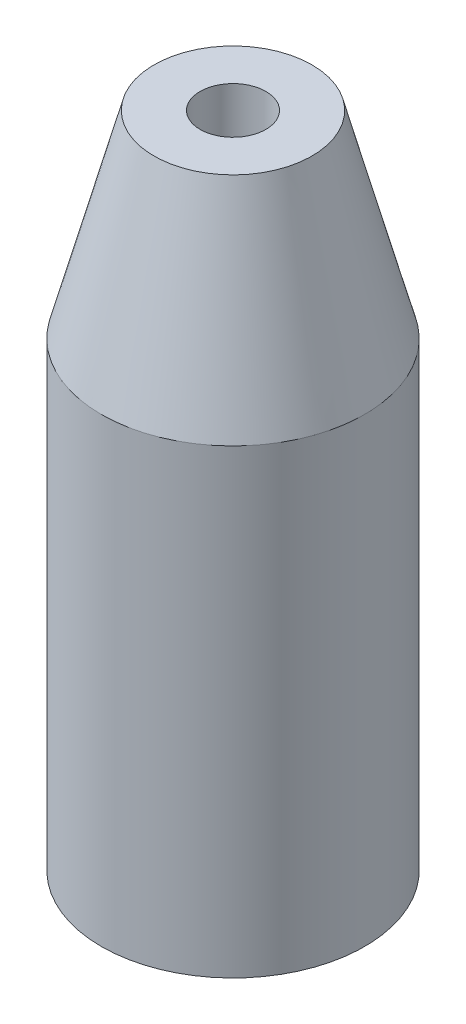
ISO-10303-21;
HEADER;
FILE_DESCRIPTION(('STEP AP214'),'2;1');
FILE_NAME('part.step','',(''),(''),'','','');
FILE_SCHEMA(('AUTOMOTIVE_DESIGN { 1 0 10303 214 1 1 1 1 }'));
ENDSEC;
DATA;
#1=APPLICATION_CONTEXT('core data for automotive mechanical design processes');
#2=APPLICATION_PROTOCOL_DEFINITION('international standard','automotive_design',2000,#1);
#3=PRODUCT_CONTEXT('',#1,'mechanical');
#4=PRODUCT('Part','Part','',(#3));
#5=PRODUCT_RELATED_PRODUCT_CATEGORY('part','',(#4));
#6=PRODUCT_DEFINITION_FORMATION('','',#4);
#7=PRODUCT_DEFINITION_CONTEXT('part definition',#1,'design');
#8=PRODUCT_DEFINITION('design','',#6,#7);
#9=PRODUCT_DEFINITION_SHAPE('','',#8);
#10=(LENGTH_UNIT() NAMED_UNIT(*) SI_UNIT(.MILLI.,.METRE.));
#11=(NAMED_UNIT(*) PLANE_ANGLE_UNIT() SI_UNIT($,.RADIAN.));
#12=(NAMED_UNIT(*) SI_UNIT($,.STERADIAN.) SOLID_ANGLE_UNIT());
#13=UNCERTAINTY_MEASURE_WITH_UNIT(LENGTH_MEASURE(1.E-05),#10,'distance_accuracy_value','');
#14=(GEOMETRIC_REPRESENTATION_CONTEXT(3) GLOBAL_UNCERTAINTY_ASSIGNED_CONTEXT((#13)) GLOBAL_UNIT_ASSIGNED_CONTEXT((#10,
#11,#12)) REPRESENTATION_CONTEXT('',''));
#15=CARTESIAN_POINT('',(0.,0.,0.));
#16=DIRECTION('',(0.,0.,1.));
#17=DIRECTION('',(1.,0.,0.));
#18=AXIS2_PLACEMENT_3D('',#15,#16,#17);
#19=CARTESIAN_POINT('',(-25.,89.9519052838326,0.));
#20=DIRECTION('',(0.,-1.,0.));
#21=DIRECTION('',(0.,0.,-1.));
#22=AXIS2_PLACEMENT_3D('',#19,#20,#21);
#23=CYLINDRICAL_SURFACE('',#22,5.);
#24=CARTESIAN_POINT('',(-25.,3.02896766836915,0.));
#25=DIRECTION('',(0.,-1.,0.));
#26=DIRECTION('',(1.,0.,0.));
#27=AXIS2_PLACEMENT_3D('',#24,#25,#26);
#28=CIRCLE('',#27,5.);
#29=CARTESIAN_POINT('',(-20.,3.02896766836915,0.));
#30=VERTEX_POINT('',#29);
#31=EDGE_CURVE('E60',#30,#30,#28,.T.);
#32=ORIENTED_EDGE('',*,*,#31,.T.);
#33=EDGE_LOOP('',(#32));
#34=FACE_BOUND('',#33,.T.);
#35=CARTESIAN_POINT('',(-25.,0.,0.));
#36=DIRECTION('',(0.,1.,0.));
#37=DIRECTION('',(0.,0.,1.));
#38=AXIS2_PLACEMENT_3D('',#35,#36,#37);
#39=CIRCLE('',#38,5.);
#40=CARTESIAN_POINT('',(-25.,0.,5.));
#41=VERTEX_POINT('',#40);
#42=EDGE_CURVE('E12',#41,#41,#39,.T.);
#43=ORIENTED_EDGE('',*,*,#42,.T.);
#44=EDGE_LOOP('',(#43));
#45=FACE_BOUND('',#44,.T.);
#46=ADVANCED_FACE('F57',(#34,#45),#23,.T.);
#47=CARTESIAN_POINT('',(-25.,0.,0.));
#48=DIRECTION('',(0.,1.,0.));
#49=DIRECTION('',(0.,0.,1.));
#50=AXIS2_PLACEMENT_3D('',#47,#48,#49);
#51=PLANE('',#50);
#52=ORIENTED_EDGE('',*,*,#42,.F.);
#53=EDGE_LOOP('',(#52));
#54=FACE_BOUND('',#53,.T.);
#55=ADVANCED_FACE('F72',(#54),#51,.F.);
#56=CARTESIAN_POINT('',(-25.,3.02896766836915,0.));
#57=DIRECTION('',(0.,-1.,0.));
#58=DIRECTION('',(1.,0.,0.));
#59=AXIS2_PLACEMENT_3D('',#56,#57,#58);
#60=PLANE('',#59);
#61=ORIENTED_EDGE('',*,*,#31,.F.);
#62=EDGE_LOOP('',(#61));
#63=FACE_BOUND('',#62,.T.);
#64=ADVANCED_FACE('F70',(#63),#60,.F.);
#65=CLOSED_SHELL('',(#46,#55,#64));
#66=MANIFOLD_SOLID_BREP('B2',#65);
#67=CARTESIAN_POINT('',(0.,0.,0.));
#68=DIRECTION('',(0.,1.,0.));
#69=DIRECTION('',(0.,0.,1.));
#70=AXIS2_PLACEMENT_3D('',#67,#68,#69);
#71=PLANE('',#70);
#72=CARTESIAN_POINT('',(0.,0.,0.));
#73=DIRECTION('',(0.,1.,0.));
#74=DIRECTION('',(0.,0.,1.));
#75=AXIS2_PLACEMENT_3D('',#72,#73,#74);
#76=CIRCLE('',#75,50.);
#77=CARTESIAN_POINT('',(0.,0.,50.));
#78=VERTEX_POINT('',#77);
#79=EDGE_CURVE('E109',#78,#78,#76,.T.);
#80=ORIENTED_EDGE('',*,*,#79,.F.);
#81=EDGE_LOOP('',(#80));
#82=FACE_BOUND('',#81,.T.);
#83=CARTESIAN_POINT('',(-25.,0.,0.));
#84=DIRECTION('',(0.,1.,0.));
#85=DIRECTION('',(0.,0.,1.));
#86=AXIS2_PLACEMENT_3D('',#83,#84,#85);
#87=CIRCLE('',#86,12.5);
#88=CARTESIAN_POINT('',(-25.,0.,12.5));
#89=VERTEX_POINT('',#88);
#90=EDGE_CURVE('E130',#89,#89,#87,.T.);
#91=ORIENTED_EDGE('',*,*,#90,.T.);
#92=EDGE_LOOP('',(#91));
#93=FACE_BOUND('',#92,.T.);
#94=ADVANCED_FACE('F98',(#82,#93),#71,.F.);
#95=CARTESIAN_POINT('',(0.,250.,0.));
#96=DIRECTION('',(0.,-1.,0.));
#97=DIRECTION('',(0.,0.,-1.));
#98=AXIS2_PLACEMENT_3D('',#95,#96,#97);
#99=CYLINDRICAL_SURFACE('',#98,50.);
#100=CARTESIAN_POINT('',(0.,174.999999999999,0.));
#101=DIRECTION('',(0.,1.,0.));
#102=DIRECTION('',(0.,0.,1.));
#103=AXIS2_PLACEMENT_3D('',#100,#101,#102);
#104=CIRCLE('',#103,50.);
#105=CARTESIAN_POINT('',(0.,174.999999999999,-50.));
#106=VERTEX_POINT('',#105);
#107=EDGE_CURVE('E56',#106,#106,#104,.F.);
#108=ORIENTED_EDGE('',*,*,#107,.T.);
#109=EDGE_LOOP('',(#108));
#110=FACE_BOUND('',#109,.T.);
#111=ORIENTED_EDGE('',*,*,#79,.T.);
#112=EDGE_LOOP('',(#111));
#113=FACE_BOUND('',#112,.T.);
#114=ADVANCED_FACE('F100',(#110,#113),#99,.T.);
#115=CARTESIAN_POINT('',(0.,250.,0.));
#116=DIRECTION('',(0.,1.,0.));
#117=DIRECTION('',(0.,0.,1.));
#118=AXIS2_PLACEMENT_3D('',#115,#116,#117);
#119=PLANE('',#118);
#120=CARTESIAN_POINT('',(0.,250.,0.));
#121=DIRECTION('',(0.,1.,0.));
#122=DIRECTION('',(0.,0.,1.));
#123=AXIS2_PLACEMENT_3D('',#120,#121,#122);
#124=CIRCLE('',#123,12.5);
#125=CARTESIAN_POINT('',(0.,250.,12.5));
#126=VERTEX_POINT('',#125);
#127=EDGE_CURVE('E113',#126,#126,#124,.T.);
#128=ORIENTED_EDGE('',*,*,#127,.F.);
#129=EDGE_LOOP('',(#128));
#130=FACE_BOUND('',#129,.T.);
#131=CARTESIAN_POINT('',(0.,250.,0.));
#132=DIRECTION('',(0.,1.,0.));
#133=DIRECTION('',(0.,0.,1.));
#134=AXIS2_PLACEMENT_3D('',#131,#132,#133);
#135=CIRCLE('',#134,30.);
#136=CARTESIAN_POINT('',(0.,250.,-30.));
#137=VERTEX_POINT('',#136);
#138=EDGE_CURVE('E105',#137,#137,#135,.T.);
#139=ORIENTED_EDGE('',*,*,#138,.T.);
#140=EDGE_LOOP('',(#139));
#141=FACE_BOUND('',#140,.T.);
#142=ADVANCED_FACE('F152',(#130,#141),#119,.T.);
#143=CARTESIAN_POINT('',(0.,250.,0.));
#144=DIRECTION('',(0.,-1.,0.));
#145=DIRECTION('',(0.,0.,-1.));
#146=AXIS2_PLACEMENT_3D('',#143,#144,#145);
#147=CONICAL_SURFACE('',#146,30.,0.260602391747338);
#148=CARTESIAN_POINT('',(0.,174.999999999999,-50.));
#149=CARTESIAN_POINT('',(0.,175.781249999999,-49.7916666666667));
#150=CARTESIAN_POINT('',(0.,176.562499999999,-49.5833333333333));
#151=CARTESIAN_POINT('',(0.,178.124999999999,-49.1666666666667));
#152=CARTESIAN_POINT('',(0.,178.906249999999,-48.9583333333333));
#153=CARTESIAN_POINT('',(0.,180.468749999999,-48.5416666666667));
#154=CARTESIAN_POINT('',(0.,181.249999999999,-48.3333333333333));
#155=CARTESIAN_POINT('',(0.,182.812499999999,-47.9166666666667));
#156=CARTESIAN_POINT('',(0.,183.593749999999,-47.7083333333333));
#157=CARTESIAN_POINT('',(0.,185.156249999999,-47.2916666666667));
#158=CARTESIAN_POINT('',(0.,185.937499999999,-47.0833333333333));
#159=CARTESIAN_POINT('',(0.,187.499999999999,-46.6666666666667));
#160=CARTESIAN_POINT('',(0.,188.281249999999,-46.4583333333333));
#161=CARTESIAN_POINT('',(0.,189.843749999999,-46.0416666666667));
#162=CARTESIAN_POINT('',(0.,190.624999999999,-45.8333333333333));
#163=CARTESIAN_POINT('',(0.,192.187499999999,-45.4166666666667));
#164=CARTESIAN_POINT('',(0.,192.968749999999,-45.2083333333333));
#165=CARTESIAN_POINT('',(0.,194.531249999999,-44.7916666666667));
#166=CARTESIAN_POINT('',(0.,195.312499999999,-44.5833333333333));
#167=CARTESIAN_POINT('',(0.,196.874999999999,-44.1666666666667));
#168=CARTESIAN_POINT('',(0.,197.656249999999,-43.9583333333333));
#169=CARTESIAN_POINT('',(0.,199.218749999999,-43.5416666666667));
#170=CARTESIAN_POINT('',(0.,199.999999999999,-43.3333333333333));
#171=CARTESIAN_POINT('',(0.,201.562499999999,-42.9166666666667));
#172=CARTESIAN_POINT('',(0.,202.343749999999,-42.7083333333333));
#173=CARTESIAN_POINT('',(0.,203.906249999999,-42.2916666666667));
#174=CARTESIAN_POINT('',(0.,204.687499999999,-42.0833333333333));
#175=CARTESIAN_POINT('',(0.,206.249999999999,-41.6666666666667));
#176=CARTESIAN_POINT('',(0.,207.031249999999,-41.4583333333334));
#177=CARTESIAN_POINT('',(0.,208.59375,-41.0416666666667));
#178=CARTESIAN_POINT('',(0.,209.375,-40.8333333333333));
#179=CARTESIAN_POINT('',(0.,210.9375,-40.4166666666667));
#180=CARTESIAN_POINT('',(0.,211.71875,-40.2083333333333));
#181=CARTESIAN_POINT('',(0.,213.28125,-39.7916666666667));
#182=CARTESIAN_POINT('',(0.,214.0625,-39.5833333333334));
#183=CARTESIAN_POINT('',(0.,215.625,-39.1666666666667));
#184=CARTESIAN_POINT('',(0.,216.40625,-38.9583333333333));
#185=CARTESIAN_POINT('',(0.,217.96875,-38.5416666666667));
#186=CARTESIAN_POINT('',(0.,218.75,-38.3333333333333));
#187=CARTESIAN_POINT('',(0.,220.3125,-37.9166666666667));
#188=CARTESIAN_POINT('',(0.,221.09375,-37.7083333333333));
#189=CARTESIAN_POINT('',(0.,222.65625,-37.2916666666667));
#190=CARTESIAN_POINT('',(0.,223.4375,-37.0833333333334));
#191=CARTESIAN_POINT('',(0.,225.,-36.6666666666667));
#192=CARTESIAN_POINT('',(0.,225.78125,-36.4583333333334));
#193=CARTESIAN_POINT('',(0.,227.34375,-36.0416666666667));
#194=CARTESIAN_POINT('',(0.,228.125,-35.8333333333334));
#195=CARTESIAN_POINT('',(0.,229.6875,-35.4166666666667));
#196=CARTESIAN_POINT('',(0.,230.46875,-35.2083333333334));
#197=CARTESIAN_POINT('',(0.,232.03125,-34.7916666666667));
#198=CARTESIAN_POINT('',(0.,232.8125,-34.5833333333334));
#199=CARTESIAN_POINT('',(0.,234.375,-34.1666666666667));
#200=CARTESIAN_POINT('',(0.,235.15625,-33.9583333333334));
#201=CARTESIAN_POINT('',(0.,236.71875,-33.5416666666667));
#202=CARTESIAN_POINT('',(0.,237.5,-33.3333333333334));
#203=CARTESIAN_POINT('',(0.,239.0625,-32.9166666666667));
#204=CARTESIAN_POINT('',(0.,239.84375,-32.7083333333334));
#205=CARTESIAN_POINT('',(0.,241.40625,-32.2916666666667));
#206=CARTESIAN_POINT('',(0.,242.1875,-32.0833333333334));
#207=CARTESIAN_POINT('',(0.,243.75,-31.6666666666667));
#208=CARTESIAN_POINT('',(0.,244.53125,-31.4583333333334));
#209=CARTESIAN_POINT('',(0.,246.09375,-31.0416666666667));
#210=CARTESIAN_POINT('',(0.,246.875,-30.8333333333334));
#211=CARTESIAN_POINT('',(0.,248.4375,-30.4166666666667));
#212=CARTESIAN_POINT('',(0.,249.21875,-30.2083333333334));
#213=CARTESIAN_POINT('',(0.,250.,-30.));
#214=B_SPLINE_CURVE_WITH_KNOTS('',3,(#148,#149,#150,#151,#152,#153,#154,#155,#156,#157,#158,
#159,#160,#161,#162,#163,#164,#165,#166,#167,#168,#169,#170,#171,#172,#173,#174,#175,#176,#177,
#178,#179,#180,#181,#182,#183,#184,#185,#186,#187,#188,#189,#190,#191,#192,#193,#194,#195,#196,
#197,#198,#199,#200,#201,#202,#203,#204,#205,#206,#207,#208,#209,#210,#211,#212,#213),
.UNSPECIFIED.,.F.,.F.,(4,2,2,2,2,2,2,2,2,2,2,2,2,2,2,2,2,2,2,2,2,2,2,2,2,2,2,2,2,2,2,2,4),(0.,
2.42565229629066,4.85130459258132,7.27695688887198,9.70260918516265,12.1282614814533,
14.5539137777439,16.9795660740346,19.4052183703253,21.8308706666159,24.2565229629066,
26.6821752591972,29.1078275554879,31.5334798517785,33.9591321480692,36.3847844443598,
38.8104367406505,41.2360890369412,43.6617413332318,46.0873936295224,48.5130459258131,
50.9386982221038,53.3643505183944,55.7900028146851,58.2156551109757,60.6413074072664,
63.066959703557,65.4926119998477,67.9182642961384,70.343916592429,72.7695688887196,
75.1952211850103,77.620873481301),.UNSPECIFIED.);
#215=EDGE_CURVE('BSEAM155',#106,#137,#214,.T.);
#216=ORIENTED_EDGE('',*,*,#107,.F.);
#217=ORIENTED_EDGE('',*,*,#138,.F.);
#218=ORIENTED_EDGE('',*,*,#215,.T.);
#219=ORIENTED_EDGE('',*,*,#215,.F.);
#220=EDGE_LOOP('',(#216,#218,#217,#219));
#221=FACE_BOUND('',#220,.T.);
#222=ADVANCED_FACE('F155',(#221),#147,.T.);
#223=CARTESIAN_POINT('',(0.,160.048094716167,0.));
#224=DIRECTION('',(0.,1.,0.));
#225=DIRECTION('',(-1.,0.,0.));
#226=AXIS2_PLACEMENT_3D('',#223,#224,#225);
#227=CYLINDRICAL_SURFACE('',#226,12.5);
#228=CARTESIAN_POINT('',(0.,160.048094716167,0.));
#229=DIRECTION('',(0.,1.,0.));
#230=DIRECTION('',(0.,0.,1.));
#231=AXIS2_PLACEMENT_3D('',#228,#229,#230);
#232=CIRCLE('',#231,12.5);
#233=CARTESIAN_POINT('',(12.5,160.048094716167,0.));
#234=VERTEX_POINT('',#233);
#235=EDGE_CURVE('E118',#234,#234,#232,.T.);
#236=ORIENTED_EDGE('',*,*,#235,.F.);
#237=EDGE_LOOP('',(#236));
#238=FACE_BOUND('',#237,.T.);
#239=ORIENTED_EDGE('',*,*,#127,.T.);
#240=EDGE_LOOP('',(#239));
#241=FACE_BOUND('',#240,.T.);
#242=ADVANCED_FACE('F162',(#238,#241),#227,.F.);
#243=CARTESIAN_POINT('',(-50.,160.048094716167,0.));
#244=DIRECTION('',(0.,0.,1.));
#245=DIRECTION('',(1.,0.,0.));
#246=AXIS2_PLACEMENT_3D('',#243,#244,#245);
#247=TOROIDAL_SURFACE('',#246,50.,12.5);
#248=CARTESIAN_POINT('',(-6.69872981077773,135.048094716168,0.));
#249=DIRECTION('',(0.499999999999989,0.866025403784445,0.));
#250=DIRECTION('',(0.,0.,1.));
#251=AXIS2_PLACEMENT_3D('',#248,#249,#250);
#252=CIRCLE('',#251,12.5);
#253=CARTESIAN_POINT('',(4.12658773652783,128.798094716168,0.));
#254=VERTEX_POINT('',#253);
#255=EDGE_CURVE('E121',#254,#254,#252,.T.);
#256=CARTESIAN_POINT('',(-50.,160.048094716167,0.));
#257=DIRECTION('',(0.,0.,1.));
#258=DIRECTION('',(1.,0.,0.));
#259=AXIS2_PLACEMENT_3D('',#256,#257,#258);
#260=CIRCLE('',#259,62.5);
#261=EDGE_CURVE('',#254,#234,#260,.T.);
#262=ORIENTED_EDGE('',*,*,#255,.F.);
#263=ORIENTED_EDGE('',*,*,#235,.T.);
#264=ORIENTED_EDGE('',*,*,#261,.T.);
#265=ORIENTED_EDGE('',*,*,#261,.F.);
#266=EDGE_LOOP('',(#262,#264,#263,#265));
#267=FACE_BOUND('',#266,.T.);
#268=ADVANCED_FACE('F167',(#267),#247,.F.);
#269=CARTESIAN_POINT('',(-18.3012701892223,114.951905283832,0.));
#270=DIRECTION('',(0.499999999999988,0.866025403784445,0.));
#271=DIRECTION('',(-0.866025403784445,0.499999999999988,0.));
#272=AXIS2_PLACEMENT_3D('',#269,#270,#271);
#273=CYLINDRICAL_SURFACE('',#272,12.5);
#274=CARTESIAN_POINT('',(-18.3012701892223,114.951905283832,0.));
#275=DIRECTION('',(0.499999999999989,0.866025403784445,0.));
#276=DIRECTION('',(0.,0.,1.));
#277=AXIS2_PLACEMENT_3D('',#274,#275,#276);
#278=CIRCLE('',#277,12.5);
#279=CARTESIAN_POINT('',(-29.1265877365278,121.201905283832,0.));
#280=VERTEX_POINT('',#279);
#281=EDGE_CURVE('E124',#280,#280,#278,.T.);
#282=ORIENTED_EDGE('',*,*,#281,.F.);
#283=EDGE_LOOP('',(#282));
#284=FACE_BOUND('',#283,.T.);
#285=ORIENTED_EDGE('',*,*,#255,.T.);
#286=EDGE_LOOP('',(#285));
#287=FACE_BOUND('',#286,.T.);
#288=ADVANCED_FACE('F143',(#284,#287),#273,.F.);
#289=CARTESIAN_POINT('',(25.,89.9519052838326,0.));
#290=DIRECTION('',(0.,0.,-1.));
#291=DIRECTION('',(-1.,0.,0.));
#292=AXIS2_PLACEMENT_3D('',#289,#290,#291);
#293=TOROIDAL_SURFACE('',#292,50.,12.5);
#294=CARTESIAN_POINT('',(-25.,89.9519052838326,0.));
#295=DIRECTION('',(0.,1.,0.));
#296=DIRECTION('',(0.,0.,1.));
#297=AXIS2_PLACEMENT_3D('',#294,#295,#296);
#298=CIRCLE('',#297,12.5);
#299=CARTESIAN_POINT('',(-37.5,89.9519052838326,0.));
#300=VERTEX_POINT('',#299);
#301=EDGE_CURVE('E127',#300,#300,#298,.T.);
#302=CARTESIAN_POINT('',(25.,89.9519052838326,0.));
#303=DIRECTION('',(0.,0.,-1.));
#304=DIRECTION('',(-1.,0.,0.));
#305=AXIS2_PLACEMENT_3D('',#302,#303,#304);
#306=CIRCLE('',#305,62.5);
#307=EDGE_CURVE('',#300,#280,#306,.T.);
#308=ORIENTED_EDGE('',*,*,#301,.F.);
#309=ORIENTED_EDGE('',*,*,#281,.T.);
#310=ORIENTED_EDGE('',*,*,#307,.T.);
#311=ORIENTED_EDGE('',*,*,#307,.F.);
#312=EDGE_LOOP('',(#308,#310,#309,#311));
#313=FACE_BOUND('',#312,.T.);
#314=ADVANCED_FACE('F137',(#313),#293,.F.);
#315=CARTESIAN_POINT('',(-25.,89.9519052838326,0.));
#316=DIRECTION('',(0.,-1.,0.));
#317=DIRECTION('',(0.,0.,-1.));
#318=AXIS2_PLACEMENT_3D('',#315,#316,#317);
#319=CYLINDRICAL_SURFACE('',#318,12.5);
#320=ORIENTED_EDGE('',*,*,#301,.T.);
#321=EDGE_LOOP('',(#320));
#322=FACE_BOUND('',#321,.T.);
#323=ORIENTED_EDGE('',*,*,#90,.F.);
#324=EDGE_LOOP('',(#323));
#325=FACE_BOUND('',#324,.T.);
#326=ADVANCED_FACE('F135',(#322,#325),#319,.F.);
#327=CLOSED_SHELL('',(#94,#114,#142,#222,#242,#268,#288,#314,#326));
#328=MANIFOLD_SOLID_BREP('B7',#327);
#329=ADVANCED_BREP_SHAPE_REPRESENTATION('',(#18,#66,#328),#14);
#330=SHAPE_DEFINITION_REPRESENTATION(#9,#329);
ENDSEC;
END-ISO-10303-21;
